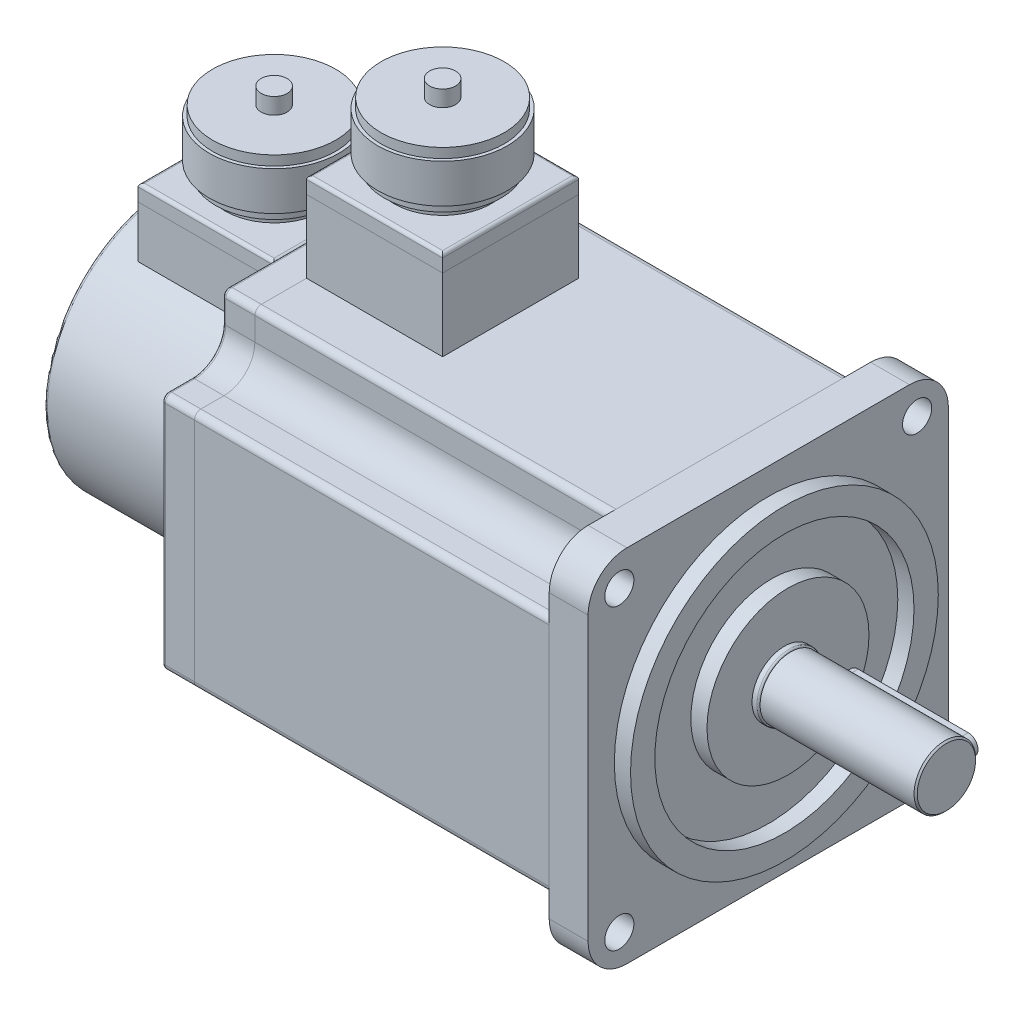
from build123d import *

# Parameters (mm, degrees)
EXTRUDE_1_DEPTH     = 10
EXTRUDE_2_DEPTH     = 109.5
EXTRUDE_3_DEPTH     = 12
CUT_EXTRUDE_1_DEPTH = 119.5
FILLET_1_R          = 1
SKETCH_7_R          = 4.5
CUT_EXTRUDE_2_DEPTH = 12
SKETCH_8_R          = 47.5
SKETCH_8_R_2        = 40
SKETCH_8_R_3        = 25
EXTRUDE_4_DEPTH     = 5
SKETCH_9_R          = 10
EXTRUDE_5_DEPTH     = 2
SKETCH_10_R         = 9.5
EXTRUDE_6_DEPTH     = 48
FILLET_2_R          = 0.5
CHAMFER_1_SIZE      = 0.5
SKETCH_13_R         = 40
EXTRUDE_8_DEPTH     = 52
SKETCH_14_W         = 42
SKETCH_14_H         = 42
CUT_EXTRUDE_4_DEPTH = 10
SKETCH_15_W         = 42
SKETCH_15_H         = 42
EXTRUDE_9_DEPTH     = 20
SKETCH_16_W         = 42
SKETCH_16_H         = 42
EXTRUDE_10_DEPTH    = 5
FILLET_3_R          = 1
SKETCH_17_R         = 15
EXTRUDE_11_DEPTH    = 3
SKETCH_18_R         = 18
EXTRUDE_12_DEPTH    = 3
SKETCH_19_R         = 20
EXTRUDE_13_DEPTH    = 12
SKETCH_20_R         = 19
EXTRUDE_14_DEPTH    = 3
SKETCH_21_R         = 4
EXTRUDE_15_DEPTH    = 5
SKETCH_22_W         = 42
SKETCH_22_H         = 42
EXTRUDE_16_DEPTH    = 22.4
SKETCH_23_W         = 42
SKETCH_23_H         = 42
EXTRUDE_17_DEPTH    = 5
FILLET_4_R          = 1
SKETCH_24_R         = 15
EXTRUDE_18_DEPTH    = 3
SKETCH_25_R         = 18
EXTRUDE_19_DEPTH    = 3
SKETCH_26_R         = 20
EXTRUDE_20_DEPTH    = 12
SKETCH_27_R         = 19
EXTRUDE_21_DEPTH    = 3
SKETCH_28_R         = 4
EXTRUDE_22_DEPTH    = 5
FILLET_5_R          = 1
CUT_EXTRUDE_5_DEPTH = 3.5
EXTRUDE_24_DEPTH    = 6


with BuildPart() as part:
    # Sketch 1 → Extrude 1 (new body)
    with BuildSketch(Plane(origin=(0, 0, 0), x_dir=(0, 0, -1), z_dir=(1, 0, 0))):
        with BuildLine():
            Line((-43.6, -55.6), (43.6, -55.6))
            ThreePointArc((43.6, -55.6), (52.085281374, -52.085281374), (55.6, -43.6))
            Line((55.6, -43.6), (55.6, 43.6))
            ThreePointArc((55.6, 43.6), (52.085281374, 52.085281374), (43.6, 55.6))
            Line((43.6, 55.6), (-43.6, 55.6))
            ThreePointArc((-43.6, 55.6), (-52.085281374, 52.085281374), (-55.6, 43.6))
            Line((-55.6, 43.6), (-55.6, -43.6))
            ThreePointArc((-55.6, -43.6), (-52.085281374, -52.085281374), (-43.6, -55.6))
        make_face()
    extrude(amount=EXTRUDE_1_DEPTH)


with BuildPart() as body_2:
    # Sketch 2 → Extrude 2 (new body)
    with BuildSketch(Plane(origin=(10, 0, 0), x_dir=(0, 0, -1), z_dir=(1, 0, 0))):
        with BuildLine():
            Line((-43.6, -55.6), (43.6, -55.6))
            ThreePointArc((43.6, -55.6), (52.085281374, -52.085281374), (55.6, -43.6))
            Line((55.6, -43.6), (55.6, 43.6))
            ThreePointArc((55.6, 43.6), (52.085281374, 52.085281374), (43.6, 55.6))
            Line((43.6, 55.6), (-43.6, 55.6))
            ThreePointArc((-43.6, 55.6), (-52.085281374, 52.085281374), (-55.6, 43.6))
            Line((-55.6, 43.6), (-55.6, -43.6))
            ThreePointArc((-55.6, -43.6), (-52.085281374, -52.085281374), (-43.6, -55.6))
        make_face()
    extrude(amount=EXTRUDE_2_DEPTH)


with BuildPart() as body_3:
    # Sketch 3 → Extrude 3 (new body)
    with BuildSketch(Plane(origin=(119.5, 0, 0), x_dir=(0, 0, -1), z_dir=(1, 0, 0))):
        with BuildLine():
            Line((-43.6, -55.6), (43.6, -55.6))
            ThreePointArc((43.6, -55.6), (52.085281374, -52.085281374), (55.6, -43.6))
            Line((55.6, -43.6), (55.6, 43.6))
            ThreePointArc((55.6, 43.6), (52.085281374, 52.085281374), (43.6, 55.6))
            Line((43.6, 55.6), (-43.6, 55.6))
            ThreePointArc((-43.6, 55.6), (-52.085281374, 52.085281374), (-55.6, 43.6))
            Line((-55.6, 43.6), (-55.6, -43.6))
            ThreePointArc((-55.6, -43.6), (-52.085281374, -52.085281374), (-43.6, -55.6))
        make_face()
    extrude(amount=EXTRUDE_3_DEPTH)

    # Sketch 7 → Cut-Extrude 2 (cut)
    with BuildSketch(Plane(origin=(131.5, 0, 0), x_dir=(0, 0, -1), z_dir=(1, 0, 0))):
        with Locations((-45.961940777, 45.961940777)):
            Circle(SKETCH_7_R)
        with Locations((45.961940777, 45.961940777)):
            Circle(SKETCH_7_R)
        with Locations((45.961940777, -45.961940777)):
            Circle(SKETCH_7_R)
        with Locations((-45.961940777, -45.961940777)):
            Circle(SKETCH_7_R)
    extrude(amount=-CUT_EXTRUDE_2_DEPTH, mode=Mode.SUBTRACT)

    # Sketch 8 → Extrude 4 (add)
    # profile 1 of 2: a face of its own
    with BuildSketch(Plane(origin=(131.5, 0, 0), x_dir=(0, 0, -1), z_dir=(1, 0, 0))):
        with Locations(Location((0, 0, 0), (0, 0, 180))):
            Circle(SKETCH_8_R)
        Circle(SKETCH_8_R_2, mode=Mode.SUBTRACT)
    # profile 2 of 2: a face of its own
    with BuildSketch(Plane(origin=(131.5, 0, 0), x_dir=(0, 0, -1), z_dir=(1, 0, 0))):
        with Locations(Location((1.103286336, 0, 0), (0, 0, 180))):
            Circle(SKETCH_8_R_3)
    extrude(amount=EXTRUDE_4_DEPTH)


with BuildPart() as cut_extrude_1_tool:
    # Sketch 6 → Cut-Extrude 1 (new body)
    with BuildSketch(Plane.ZY):
        with BuildLine():
            Line((-46.5, 36.949083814), (-53.6, 36.949083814))
            ThreePointArc((-53.6, 36.949083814), (-55.014213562, 36.363297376), (-55.6, 34.949083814))
            Line((-55.6, 34.949083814), (-55.6, 43.6))
            ThreePointArc((-55.6, 43.6), (-52.085281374, 52.085281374), (-43.6, 55.6))
            Line((-43.6, 55.6), (-34.949083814, 55.6))
            ThreePointArc((-34.949083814, 55.6), (-36.363297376, 55.014213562), (-36.949083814, 53.6))
            Line((-36.949083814, 53.6), (-36.949083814, 46.5))
            ThreePointArc((-36.949083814, 46.5), (-39.746482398, 39.746482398), (-46.5, 36.949083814))
        make_face()
        with BuildLine():
            Line((34.949083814, 55.6), (43.6, 55.6))
            ThreePointArc((43.6, 55.6), (52.085281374, 52.085281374), (55.6, 43.6))
            Line((55.6, 43.6), (55.6, 34.949083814))
            ThreePointArc((55.6, 34.949083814), (55.014213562, 36.363297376), (53.6, 36.949083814))
            Line((53.6, 36.949083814), (46.5, 36.949083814))
            ThreePointArc((46.5, 36.949083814), (39.746482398, 39.746482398), (36.949083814, 46.5))
            Line((36.949083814, 46.5), (36.949083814, 53.6))
            ThreePointArc((36.949083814, 53.6), (36.363297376, 55.014213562), (34.949083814, 55.6))
        make_face()
        with BuildLine():
            Line((-53.6, -36.949083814), (-46.5, -36.949083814))
            ThreePointArc((-46.5, -36.949083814), (-39.746482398, -39.746482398), (-36.949083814, -46.5))
            Line((-36.949083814, -46.5), (-36.949083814, -53.6))
            ThreePointArc((-36.949083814, -53.6), (-36.363297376, -55.014213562), (-34.949083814, -55.6))
            Line((-34.949083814, -55.6), (-43.6, -55.6))
            ThreePointArc((-43.6, -55.6), (-52.085281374, -52.085281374), (-55.6, -43.6))
            Line((-55.6, -43.6), (-55.6, -34.949083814))
            ThreePointArc((-55.6, -34.949083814), (-55.014213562, -36.363297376), (-53.6, -36.949083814))
        make_face()
        with BuildLine():
            Line((55.6, -34.949083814), (55.6, -43.6))
            ThreePointArc((55.6, -43.6), (52.085281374, -52.085281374), (43.6, -55.6))
            Line((43.6, -55.6), (34.949083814, -55.6))
            ThreePointArc((34.949083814, -55.6), (36.363297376, -55.014213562), (36.949083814, -53.6))
            Line((36.949083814, -53.6), (36.949083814, -46.5))
            ThreePointArc((36.949083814, -46.5), (39.746482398, -39.746482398), (46.5, -36.949083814))
            Line((46.5, -36.949083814), (53.6, -36.949083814))
            ThreePointArc((53.6, -36.949083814), (55.014213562, -36.363297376), (55.6, -34.949083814))
        make_face()
    extrude(amount=-CUT_EXTRUDE_1_DEPTH)


with BuildPart() as part_1:
    add(part.part)

    # Cut-Extrude 1: cut by cut_extrude_1_tool
    add(cut_extrude_1_tool.part, mode=Mode.SUBTRACT)

    # Fillet 1
    fillet_1_edges = [part_1.edges().sort_by_distance(p)[0] for p in [
        (0, 39.746482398, 39.746482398),
        (0, 36.949083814, 50.05),
        (0, 36.363297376, 55.014213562),
        (0, 55.014213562, 36.363297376),
        (0, 50.05, 36.949083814),
        (0, 0, 55.6),
        (0, 55.6, 0),
        (0, 0, -55.6),
        (0, -55.6, 0),
        (0, 55.014213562, -36.363297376),
        (0, 36.363297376, -55.014213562),
        (0, 36.949083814, -50.05),
        (0, 39.746482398, -39.746482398),
        (0, 50.05, -36.949083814),
        (0, -39.746482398, -39.746482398),
        (0, -36.949083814, -50.05),
        (0, -36.363297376, -55.014213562),
        (0, -55.014213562, -36.363297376),
        (0, -50.05, -36.949083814),
        (0, -39.746482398, 39.746482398),
        (0, -50.05, 36.949083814),
        (0, -55.014213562, 36.363297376),
        (0, -36.363297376, 55.014213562),
        (0, -36.949083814, 50.05),
    ]]
    fillet(fillet_1_edges, radius=FILLET_1_R)



with BuildPart() as body_2_1:
    add(body_2.part)

    # Cut-Extrude 1: cut by cut_extrude_1_tool
    add(cut_extrude_1_tool.part, mode=Mode.SUBTRACT)


with BuildPart() as body_4:
    # Sketch 9 → Extrude 5 (new body)
    with BuildSketch(Plane(origin=(136.5, 0, 0), x_dir=(0, 0, -1), z_dir=(1, 0, 0))):
        Circle(SKETCH_9_R)
    extrude(amount=EXTRUDE_5_DEPTH)

    # Fillet 2
    fillet_2_edges = [body_4.edges().sort_by_distance(p)[0] for p in [
        (138.5, 0, 10),
    ]]
    fillet(fillet_2_edges, radius=FILLET_2_R)


with BuildPart() as body_5:
    # Sketch 10 → Extrude 6 (new body)
    with BuildSketch(Plane(origin=(138.5, 0, 0), x_dir=(0, 0, -1), z_dir=(1, 0, 0))):
        Circle(SKETCH_10_R)
    extrude(amount=EXTRUDE_6_DEPTH)

    # Chamfer 1
    chamfer_1_edges = [body_5.edges().sort_by_distance(p)[0] for p in [
        (186.5, 0, 9.5),
    ]]
    chamfer(chamfer_1_edges, length=CHAMFER_1_SIZE)

    # Sketch 11 → Cut-Extrude 5 (cut)
    with BuildSketch(Plane.XY.offset(-9.75)):
        with BuildLine():
            Line((181, 3), (147, 3))
            ThreePointArc((147, 3), (144, 0), (147, -3))
            Line((147, -3), (181, -3))
            ThreePointArc((181, -3), (184, 0), (181, 3))
        make_face()
    extrude(amount=CUT_EXTRUDE_5_DEPTH, mode=Mode.SUBTRACT)


with BuildPart() as body_6:
    # Sketch 13 → Extrude 8 (new body)
    with BuildSketch(Plane.ZY):
        with Locations(Location((0, 0, 0), (0, 0, 180))):
            Circle(SKETCH_13_R)
    extrude(amount=EXTRUDE_8_DEPTH)

    # Sketch 14 → Cut-Extrude 4 (cut)
    with BuildSketch(Plane(origin=(0, 40, 0), x_dir=(1, 0, 0), z_dir=(0, 1, 0))):
        with Locations((-21, 0)):
            Rectangle(SKETCH_14_W, SKETCH_14_H)
    extrude(amount=-CUT_EXTRUDE_4_DEPTH, mode=Mode.SUBTRACT)


with BuildPart() as part_2:
    add(part_1.part)

    add(body_6.part)  # Extrude 9 merges body 6
    # Sketch 15 → Extrude 9 (add)
    with BuildSketch(Plane(origin=(0, 30, 0), x_dir=(1, 0, 0), z_dir=(0, 1, 0))):
        with Locations((-21, 0)):
            Rectangle(SKETCH_15_W, SKETCH_15_H)
    extrude(amount=EXTRUDE_9_DEPTH)

    # Fillet 5
    fillet_5_edges = [part_2.edges().sort_by_distance(p)[0] for p in [
        (-52, 0, 40),
    ]]
    fillet(fillet_5_edges, radius=FILLET_5_R)


with BuildPart() as body_6_2:
    # Sketch 16 → Extrude 10 (new body)
    with BuildSketch(Plane(origin=(0, 50, 0), x_dir=(1, 0, 0), z_dir=(0, 1, 0))):
        with Locations((-21, 0)):
            Rectangle(SKETCH_16_W, SKETCH_16_H)
    extrude(amount=EXTRUDE_10_DEPTH)

    # Fillet 3
    fillet_3_edges = [body_6_2.edges().sort_by_distance(p)[0] for p in [
        (-42, 55, 0),
        (-21, 55, 21),
        (0, 55, 0),
        (-21, 55, -21),
    ]]
    fillet(fillet_3_edges, radius=FILLET_3_R)


with BuildPart() as body_7:
    # Sketch 17 → Extrude 11 (new body)
    with BuildSketch(Plane(origin=(0, 55, 0), x_dir=(1, 0, 0), z_dir=(0, 1, 0))):
        with Locations(Location((-21, 0, 0), (0, 0, 270))):
            Circle(SKETCH_17_R)
    extrude(amount=EXTRUDE_11_DEPTH)

    # Sketch 18 → Extrude 12 (add)
    with BuildSketch(Plane(origin=(0, 58, 0), x_dir=(1, 0, 0), z_dir=(0, 1, 0))):
        with Locations(Location((-21, 0, 0), (0, 0, 270))):
            Circle(SKETCH_18_R)
    extrude(amount=EXTRUDE_12_DEPTH)

    # Sketch 19 → Extrude 13 (add)
    with BuildSketch(Plane(origin=(0, 61, 0), x_dir=(1, 0, 0), z_dir=(0, 1, 0))):
        with Locations(Location((-21, 0, 0), (0, 0, 270))):
            Circle(SKETCH_19_R)
    extrude(amount=EXTRUDE_13_DEPTH)

    # Sketch 20 → Extrude 14 (add)
    with BuildSketch(Plane(origin=(0, 73, 0), x_dir=(1, 0, 0), z_dir=(0, 1, 0))):
        with Locations(Location((-21, 0, 0), (0, 0, 270))):
            Circle(SKETCH_20_R)
    extrude(amount=EXTRUDE_14_DEPTH)

    # Sketch 21 → Extrude 15 (add)
    with BuildSketch(Plane(origin=(0, 76, 0), x_dir=(1, 0, 0), z_dir=(0, 1, 0))):
        with Locations(Location((-21, 0, 0), (0, 0, 270))):
            Circle(SKETCH_21_R)
    extrude(amount=EXTRUDE_15_DEPTH)


with BuildPart() as body_8:
    # Sketch 22 → Extrude 16 (new body)
    with BuildSketch(Plane(origin=(0, 55.6, 0), x_dir=(1, 0, 0), z_dir=(0, 1, 0))):
        with Locations((31, 0)):
            Rectangle(SKETCH_22_W, SKETCH_22_H)
    extrude(amount=EXTRUDE_16_DEPTH)


with BuildPart() as body_9:
    # Sketch 23 → Extrude 17 (new body)
    with BuildSketch(Plane(origin=(0, 78, 0), x_dir=(1, 0, 0), z_dir=(0, 1, 0))):
        with Locations((31, 0)):
            Rectangle(SKETCH_23_W, SKETCH_23_H)
    extrude(amount=EXTRUDE_17_DEPTH)

    # Fillet 4
    fillet_4_edges = [body_9.edges().sort_by_distance(p)[0] for p in [
        (10, 83, 0),
        (31, 83, 21),
        (52, 83, 0),
        (31, 83, -21),
    ]]
    fillet(fillet_4_edges, radius=FILLET_4_R)


with BuildPart() as body_10:
    # Sketch 24 → Extrude 18 (new body)
    with BuildSketch(Plane(origin=(0, 83, 0), x_dir=(1, 0, 0), z_dir=(0, 1, 0))):
        with Locations(Location((31, 0, 0), (0, 0, 270))):
            Circle(SKETCH_24_R)
    extrude(amount=EXTRUDE_18_DEPTH)


with BuildPart() as body_11:
    # Sketch 25 → Extrude 19 (new body)
    with BuildSketch(Plane(origin=(0, 86, 0), x_dir=(1, 0, 0), z_dir=(0, 1, 0))):
        with Locations(Location((31, 0, 0), (0, 0, 270))):
            Circle(SKETCH_25_R)
    extrude(amount=EXTRUDE_19_DEPTH)


with BuildPart() as body_12:
    # Sketch 26 → Extrude 20 (new body)
    with BuildSketch(Plane(origin=(0, 89, 0), x_dir=(1, 0, 0), z_dir=(0, 1, 0))):
        with Locations(Location((31, 0, 0), (0, 0, 270))):
            Circle(SKETCH_26_R)
    extrude(amount=EXTRUDE_20_DEPTH)


with BuildPart() as body_13:
    # Sketch 27 → Extrude 21 (new body)
    with BuildSketch(Plane(origin=(0, 101, 0), x_dir=(1, 0, 0), z_dir=(0, 1, 0))):
        with Locations(Location((31, 0, 0), (0, 0, 270))):
            Circle(SKETCH_27_R)
    extrude(amount=EXTRUDE_21_DEPTH)


with BuildPart() as body_14:
    # Sketch 28 → Extrude 22 (new body)
    with BuildSketch(Plane(origin=(0, 104, 0), x_dir=(1, 0, 0), z_dir=(0, 1, 0))):
        with Locations(Location((31, 0, 0), (0, 0, 270))):
            Circle(SKETCH_28_R)
    extrude(amount=EXTRUDE_22_DEPTH)


with BuildPart() as body_15:
    # Sketch 32 → Extrude 24 (new body)
    with BuildSketch(Plane(origin=(0, 0, -6.25), x_dir=(-1, 0, 0), z_dir=(0, 0, -1))):
        with BuildLine():
            Line((-181, 3), (-147, 3))
            ThreePointArc((-147, 3), (-144, 0), (-147, -3))
            Line((-147, -3), (-181, -3))
            ThreePointArc((-181, -3), (-184, 0), (-181, 3))
        make_face()
    extrude(amount=EXTRUDE_24_DEPTH)


solid = Compound([body_3.part, body_2_1.part, body_4.part, body_5.part, part_2.part, body_6_2.part, body_7.part, body_8.part, body_9.part, body_10.part, body_11.part, body_12.part, body_13.part, body_14.part, body_15.part])
